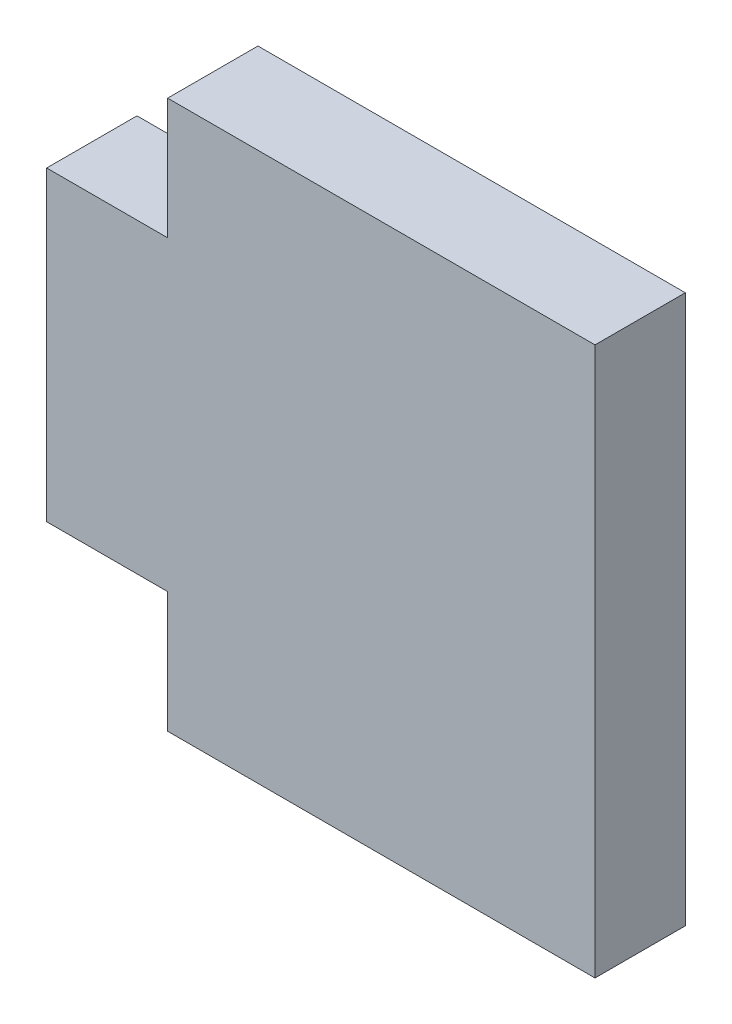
from build123d import *

# Parameters (mm, degrees)
SKETCH1_W           = 43.18
SKETCH1_H           = 43.18
BOSS_EXTRUDE1_DEPTH = 7.112
SKETCH2_W           = 9.525
SKETCH2_H           = 9.525
CUT_EXTRUDE1_DEPTH  = 18.796


with BuildPart() as part:
    # Sketch1 → Boss-Extrude1 (new body)
    with BuildSketch(Plane.XY):
        with Locations((21.59, 21.59)):
            Rectangle(SKETCH1_W, SKETCH1_H)
    extrude(amount=BOSS_EXTRUDE1_DEPTH)

    # Sketch2 → Cut-Extrude1 (cut)
    with BuildSketch(Plane.XY.offset(7.112)):
        with Locations((4.7625, 38.4175)):
            Rectangle(SKETCH2_W, SKETCH2_H)
        with Locations((4.7625, 4.7625)):
            Rectangle(SKETCH2_W, SKETCH2_H)
    extrude(amount=-CUT_EXTRUDE1_DEPTH, mode=Mode.SUBTRACT)


solid = part.part
